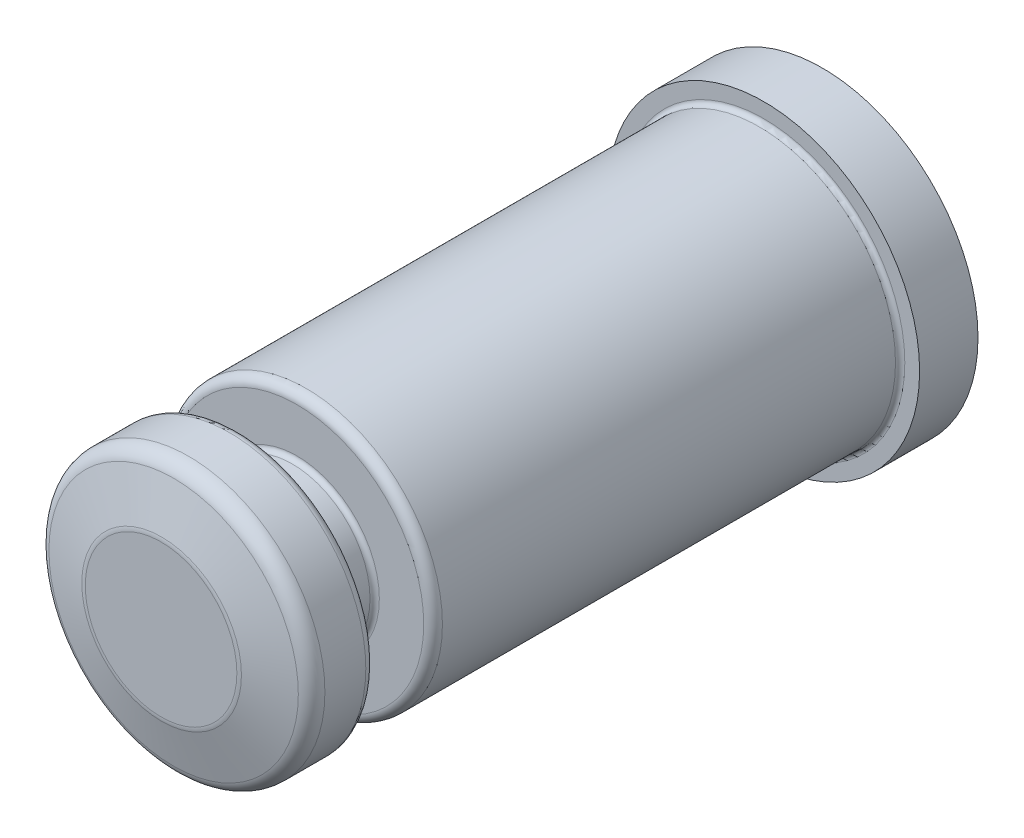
from build123d import *


with BuildPart() as part:
    # Sketch2 → Revolve1 (revolve)
    with BuildSketch(Plane.XZ, mode=Mode.PRIVATE) as revolve1_sk:
        with BuildLine():
            Line((0, -42.8625), (-12.7, -42.8625))
            Line((-12.7, -42.8625), (-12.7, -38.1))
            Line((-12.7, -38.1), (-11.4935, -38.1))
            ThreePointArc((-11.4935, -38.1), (-11.224092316, -37.988407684), (-11.1125, -37.719))
            Line((-11.1125, -37.719), (-11.1125, -0.762))
            ThreePointArc((-11.1125, -0.762), (-10.889315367, -0.223184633), (-10.3505, 0))
            Line((-10.3505, 0), (-6.731, 0))
            ThreePointArc((-6.731, 0), (-6.461592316, 0.111592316), (-6.35, 0.381))
            Line((-6.35, 0.381), (-6.35, 4.3434))
            ThreePointArc((-6.35, 4.3434), (-6.461592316, 4.612807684), (-6.731, 4.7244))
            Line((-6.731, 4.7244), (-10.3505, 4.7244))
            ThreePointArc((-10.3505, 4.7244), (-10.889315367, 4.947584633), (-11.1125, 5.4864))
            Line((-11.1125, 5.4864), (-11.1125, 8.823786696))
            ThreePointArc((-11.1125, 8.823786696), (-10.850058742, 9.596913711), (-10.171200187, 10.050512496))
            Line((-10.171200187, 10.050512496), (-6.511501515, 11.031125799))
            ThreePointArc((-6.511501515, 11.031125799), (-6.348569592, 11.063534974), (-6.182801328, 11.0744))
            Line((-6.182801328, 11.0744), (0, 11.0744))
            Line((0, 11.0744), (0, -42.8625))
        make_face()
    revolve(revolve1_sk.sketch.rotate(Axis((0, 0, 16.276157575), (0, 0, -1)), 180), axis=Axis((0, 0, 16.276157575), (0, 0, -1)))


solid = part.part
